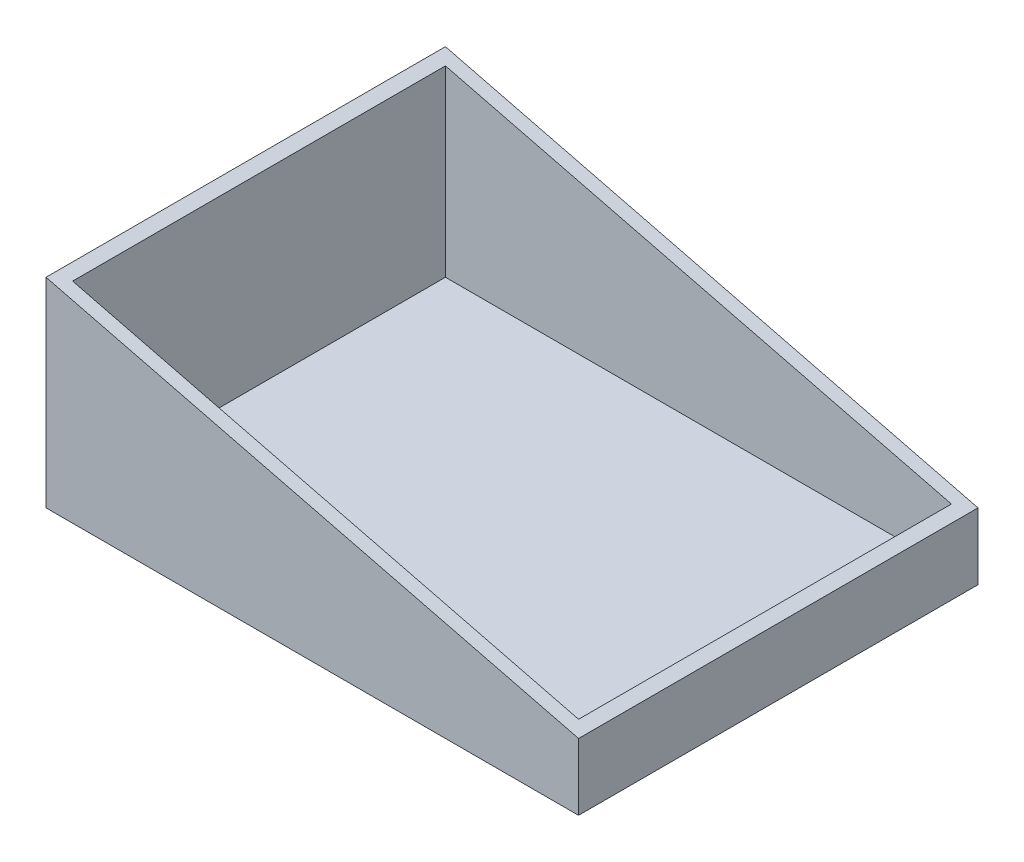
from build123d import *

# Parameters (mm, degrees)
EXTRUDE1_DEPTH = 76.2
SHELL1_T       = -2.54


with BuildPart() as part:
    # Sketch1 → Extrude1 (new body)
    with BuildSketch(Plane.XY):
        Polygon((0, 0), (0, 38.1), (101.6, 12.7), (101.6, 0), align=None)
    extrude(amount=-EXTRUDE1_DEPTH)

    # Shell1
    shell1_openings = [part.faces().sort_by_distance(p)[0] for p in [
        (50.8, 25.4, -38.1),
    ]]
    offset(amount=SHELL1_T, openings=shell1_openings, kind=Kind.INTERSECTION)


solid = part.part
